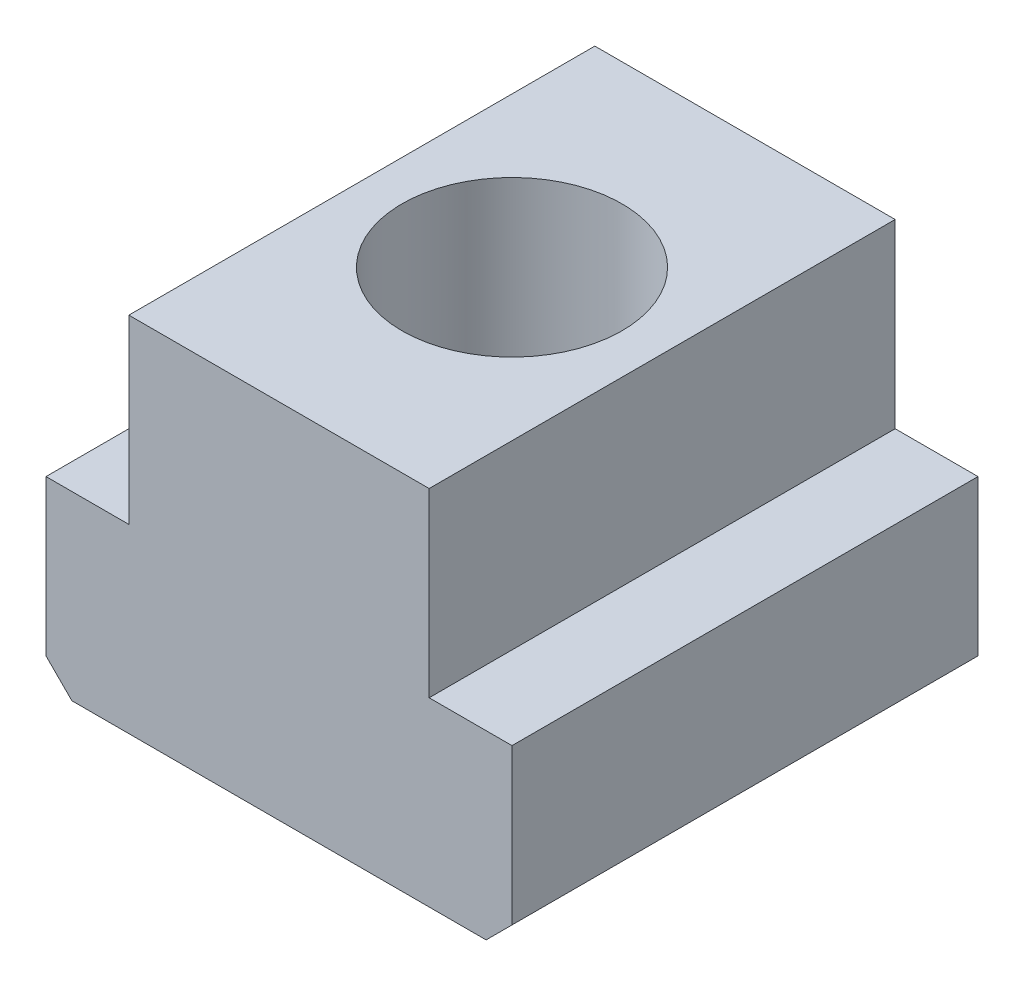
from build123d import *

# Parameters (mm, degrees)
BOSS_EXTRUDE1_DEPTH      = 9
BOSS_EXTRUDE1_DEPTH_BACK = 9
M10_TAPPED_HOLE1_D       = 8.5


with BuildPart() as part:
    # Sketch1 → Boss-Extrude1 (new, two sides: drawn at the far end of the back side and taken through both)
    with BuildSketch(Plane.XY.offset(-BOSS_EXTRUDE1_DEPTH_BACK)):
        Polygon((8, 0), (-8, 0), (-9, 1), (-9, 7), (-5.8, 7), (-5.8, 14), (5.8, 14), (5.8, 7), (9, 7), (9, 1), align=None)
    extrude(amount=BOSS_EXTRUDE1_DEPTH + BOSS_EXTRUDE1_DEPTH_BACK)

    # M10 Tapped Hole1 (through all)
    with Locations(Plane.ZX.offset(14)):
        with Locations((0, 0)):
            Hole(M10_TAPPED_HOLE1_D / 2)


solid = part.part
